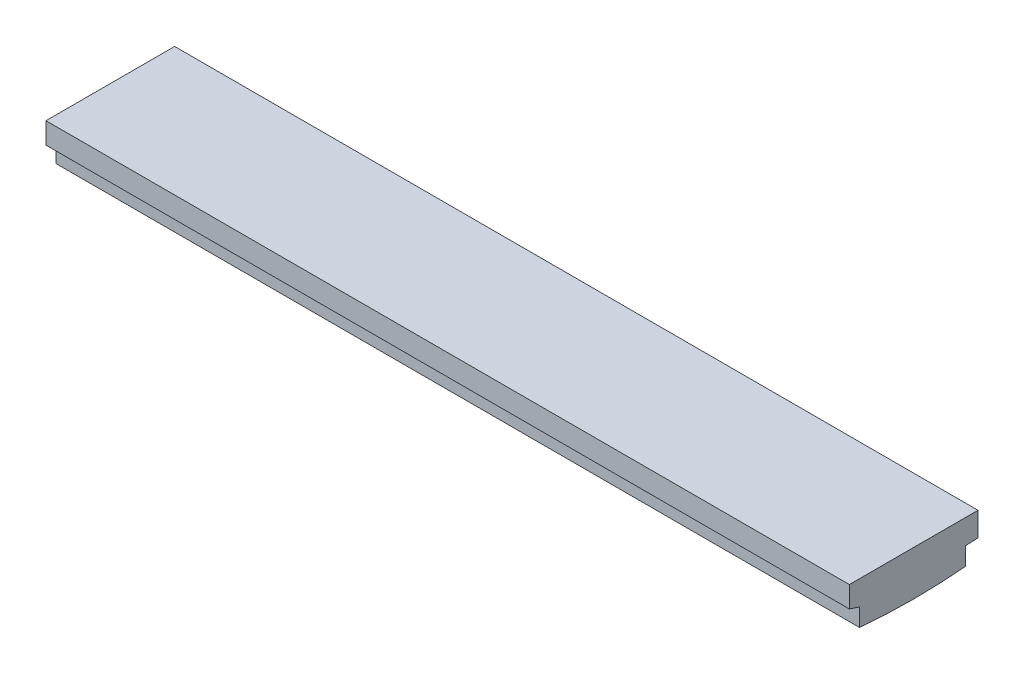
from build123d import *

# Parameters (mm, degrees)
SKETCH1_W          = 12
SKETCH1_H          = 4.05
EXTRUDE1_DEPTH     = 45.5
EXTRUDE2_DEPTH     = 45.5
CUT_EXTRUDE1_DEPTH = 92.420609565
EXTRUDE3_DEPTH     = 91
EXTRUDE4_DEPTH     = 91


with BuildPart() as part:
    # Sketch1 → Extrude1 (new, symmetric)
    with BuildSketch(Plane(origin=(0, 0, 0), x_dir=(0, 0, -1), z_dir=(1, 0, 0))):
        Rectangle(SKETCH1_W, SKETCH1_H)
    extrude(amount=EXTRUDE1_DEPTH, both=True)

    # Sketch2 → Extrude2 (add, symmetric)
    with BuildSketch(Plane(origin=(0, 0, 0), x_dir=(0, 0, -1), z_dir=(1, 0, 0))):
        Polygon((-8.308262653, 2.775), (7.410544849, 2.775), (6, 2.025), (-6, 2.025), align=None)
    extrude(amount=EXTRUDE2_DEPTH, both=True)

    # Sketch3 → Cut-Extrude1 (cut, through all)
    with BuildSketch(Plane(origin=(45.5, 0, 0), x_dir=(0, 0, -1), z_dir=(1, 0, 0))):
        Polygon((-8.308262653, 2.775), (-6.929230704, 2.326925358), (-7.158262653, 2.775), align=None)
    extrude(amount=-CUT_EXTRUDE1_DEPTH, mode=Mode.SUBTRACT)

    # Sketch4 → Extrude3 (add)
    with BuildSketch(Plane(origin=(45.5, 0, 0), x_dir=(0, 0, -1), z_dir=(1, 0, 0))):
        with BuildLine():
            Line((-6, -2.025), (6, -2.025))
            ThreePointArc((6, -2.025), (0, -2.292195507), (-6, -2.025))
        make_face()
    extrude(amount=-EXTRUDE3_DEPTH)

    # Sketch5 → Extrude4 (add)
    with BuildSketch(Plane(origin=(45.5, 0, 0), x_dir=(0, 0, -1), z_dir=(1, 0, 0))):
        Polygon((7.410544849, 2.775), (6, 2.025), (6, 0), (7.410544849, 0.06281521), align=None)
        Polygon((-6, 2.025), (-7.158262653, 2.775), (-7.158262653, 0.376342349), (-6, 0), align=None)
    extrude(amount=-EXTRUDE4_DEPTH)


solid = part.part
